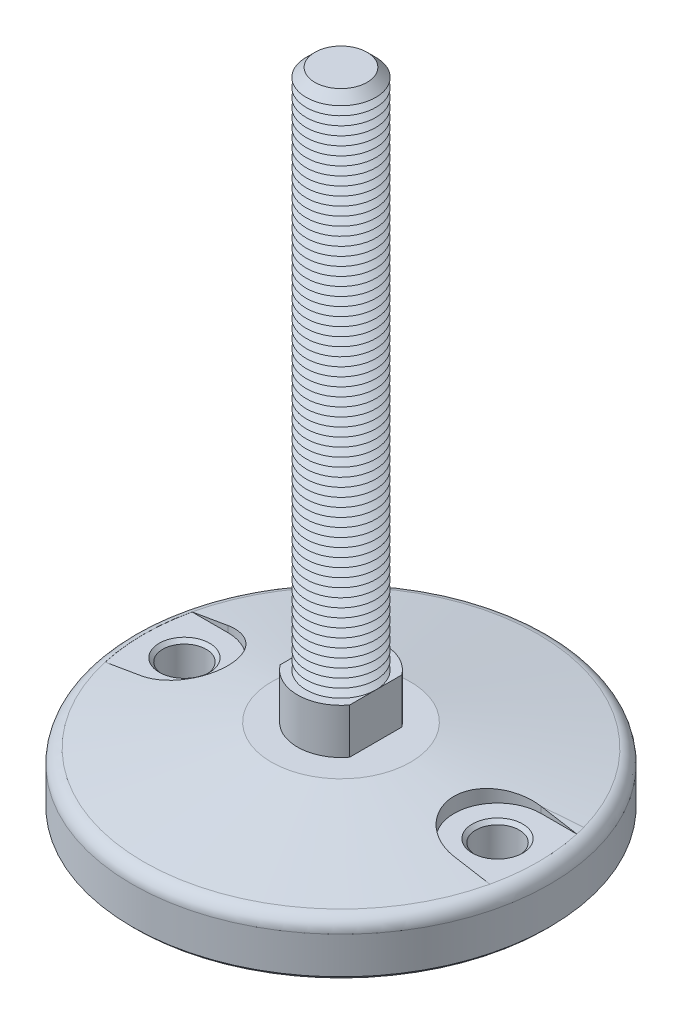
from build123d import *

# Parameters (mm, degrees)
FILLET1_R                = 4
SKETCH3_R                = 12.5
BOSS_EXTRUDE1_DEPTH      = 13
CUT_EXTRUDE1_START       = -13
CUT_EXTRUDE1_DEPTH       = 13
SKETCH5_R                = 10
BOSS_EXTRUDE2_DEPTH      = 150
CHAMFER1_SIZE            = 2.5
LPATTERN1_COUNT          = 59
LPATTERN1_PITCH          = 2.5
CUT_EXTRUDE4_DEPTH       = 6.5
SKETCH10_R               = 6.25
CUT_EXTRUDE5_DEPTH       = 15.5
CHAMFER2_SIZE            = 1
CHAMFER2_OF_MIRROR1_SIZE = 1
CHAMFER3_SIZE            = 1


with BuildPart() as part:
    # Sketch2 → Revolve1 (revolve)
    with BuildSketch(Plane(origin=(0, 0, 0), x_dir=(0, 0, -1), z_dir=(1, 0, 0)), mode=Mode.PRIVATE) as revolve1_sk:
        Polygon((0, 0), (-20, 0), (-60, -7.053079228), (-60, -22), (0, -22), align=None)
    revolve(revolve1_sk.sketch.rotate(Axis((0, 61.338865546, 0), (0, -1, 0)), 180), axis=Axis((0, 61.338865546, 0), (0, -1, 0)))

    # Fillet1
    fillet1_edges = [part.edges().sort_by_distance(p)[0] for p in [
        (0, -7.053079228, 60),
    ]]
    fillet(fillet1_edges, radius=FILLET1_R)

    # Sketch3 → Boss-Extrude1 (add)
    with BuildSketch(Plane(origin=(0, 0, 0), x_dir=(1, 0, 0), z_dir=(0, 1, 0))):
        with Locations(Location((0, 0, 0), (0, 0, 90))):
            Circle(SKETCH3_R)
    extrude(amount=BOSS_EXTRUDE1_DEPTH)

    # Sketch4 → Cut-Extrude1 (cut)
    with BuildSketch(Plane(origin=(0, 13, 0), x_dir=(1, 0, 0), z_dir=(0, 1, 0)).offset(CUT_EXTRUDE1_START)):
        with BuildLine():
            Line((-10, 7.5), (-10, -7.5))
            ThreePointArc((-10, -7.5), (-12.5, 0), (-10, 7.5))
        make_face()
        with BuildLine():
            Line((10, -7.5), (10, 7.5))
            ThreePointArc((10, 7.5), (12.5, 0), (10, -7.5))
        make_face()
    extrude(amount=CUT_EXTRUDE1_DEPTH, mode=Mode.SUBTRACT)

    # Sketch5 → Boss-Extrude2 (add)
    with BuildSketch(Plane(origin=(0, 13, 0), x_dir=(1, 0, 0), z_dir=(0, 1, 0))):
        with Locations(Location((0, 0, 0), (0, 0, 180))):
            Circle(SKETCH5_R)
    extrude(amount=BOSS_EXTRUDE2_DEPTH)

    # Chamfer1
    chamfer1_edges = [part.edges().sort_by_distance(p)[0] for p in [
        (10, 163, 0),
    ]]
    chamfer(chamfer1_edges, length=CHAMFER1_SIZE)

    # Sketch6 → Cut-Revolve1 (revolve, cut)
    with BuildSketch(Plane(origin=(0, 0, 0), x_dir=(0, 0, -1), z_dir=(1, 0, 0))):
        Polygon((-10, 13), (-7.834936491, 14.25), (-10, 15.5), align=None)
    cut_revolve1 = revolve(axis=Axis((0, 61.338865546, 0), (0, -1, 0)), mode=Mode.SUBTRACT)

    # LPattern1: Cut-Revolve1 ×59
    with Locations(*[(0, i * LPATTERN1_PITCH, 0) for i in range(1, LPATTERN1_COUNT)]):
        add(cut_revolve1, mode=Mode.SUBTRACT)

    # Sketch8 → Cut-Extrude4 (cut)
    with BuildSketch(Plane(origin=(0, 0, 0), x_dir=(1, 0, 0), z_dir=(0, 1, 0))):
        with BuildLine():
            Line((-45, 12.5), (-55.299428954, 12.5))
            ThreePointArc((-55.299428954, 12.5), (-56.694592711, 0), (-55.299428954, -12.5))
            Line((-55.299428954, -12.5), (-45, -12.5))
            ThreePointArc((-45, -12.5), (-32.5, 0), (-45, 12.5))
        make_face()
    cut_extrude4 = extrude(amount=-CUT_EXTRUDE4_DEPTH, mode=Mode.SUBTRACT)

    # Sketch10 → Cut-Extrude5 (cut)
    with BuildSketch(Plane(origin=(0, -6.5, 0), x_dir=(1, 0, 0), z_dir=(0, 1, 0))):
        with Locations(Location((-45, 0, 0), (0, 0, 270))):
            Circle(SKETCH10_R)
    cut_extrude5 = extrude(amount=-CUT_EXTRUDE5_DEPTH, mode=Mode.SUBTRACT)

    # Chamfer2
    chamfer2_edges = [part.edges().sort_by_distance(p)[0] for p in [
        (-45, -6.5, -6.25),
        (-45, -22, -6.25),
    ]]
    chamfer(chamfer2_edges, length=CHAMFER2_SIZE)

    # Mirror1: Cut-Extrude4, Cut-Extrude5 across plane
    add(cut_extrude4.mirror(Plane(origin=(0, 0, 0), x_dir=(0, 0, 1), z_dir=(1, 0, 0))), mode=Mode.SUBTRACT)
    add(cut_extrude5.mirror(Plane(origin=(0, 0, 0), x_dir=(0, 0, 1), z_dir=(1, 0, 0))), mode=Mode.SUBTRACT)

    # Chamfer2 of Mirror1
    chamfer2_of_mirror1_edges = [part.edges().sort_by_distance(p)[0] for p in [
        (45, -6.5, -6.25),
        (45, -22, -6.25),
    ]]
    chamfer(chamfer2_of_mirror1_edges, length=CHAMFER2_OF_MIRROR1_SIZE)

    # Chamfer3
    chamfer3_edges = [part.edges().sort_by_distance(p)[0] for p in [
        (0, -22, 60),
    ]]
    chamfer(chamfer3_edges, length=CHAMFER3_SIZE)


solid = part.part
